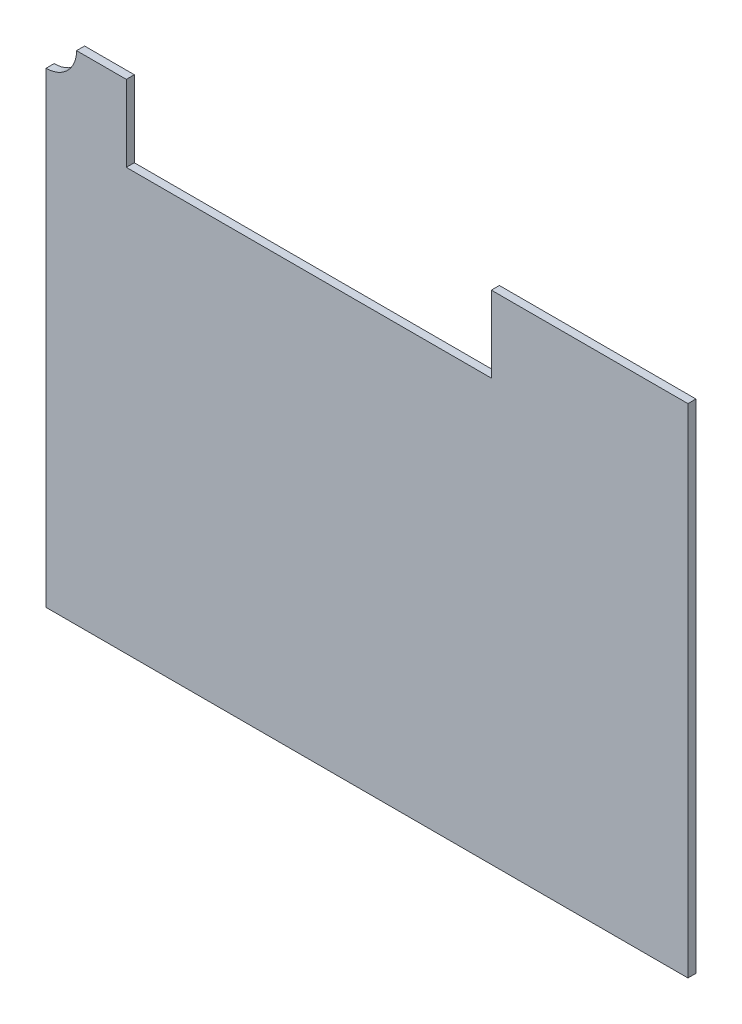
ISO-10303-21;
HEADER;
FILE_DESCRIPTION(('STEP AP214'),'2;1');
FILE_NAME('part.step','',(''),(''),'','','');
FILE_SCHEMA(('AUTOMOTIVE_DESIGN { 1 0 10303 214 1 1 1 1 }'));
ENDSEC;
DATA;
#1=APPLICATION_CONTEXT('core data for automotive mechanical design processes');
#2=APPLICATION_PROTOCOL_DEFINITION('international standard','automotive_design',2000,#1);
#3=PRODUCT_CONTEXT('',#1,'mechanical');
#4=PRODUCT('Part','Part','',(#3));
#5=PRODUCT_RELATED_PRODUCT_CATEGORY('part','',(#4));
#6=PRODUCT_DEFINITION_FORMATION('','',#4);
#7=PRODUCT_DEFINITION_CONTEXT('part definition',#1,'design');
#8=PRODUCT_DEFINITION('design','',#6,#7);
#9=PRODUCT_DEFINITION_SHAPE('','',#8);
#10=(LENGTH_UNIT() NAMED_UNIT(*) SI_UNIT(.MILLI.,.METRE.));
#11=(NAMED_UNIT(*) PLANE_ANGLE_UNIT() SI_UNIT($,.RADIAN.));
#12=(NAMED_UNIT(*) SI_UNIT($,.STERADIAN.) SOLID_ANGLE_UNIT());
#13=UNCERTAINTY_MEASURE_WITH_UNIT(LENGTH_MEASURE(1.E-05),#10,'distance_accuracy_value','');
#14=(GEOMETRIC_REPRESENTATION_CONTEXT(3) GLOBAL_UNCERTAINTY_ASSIGNED_CONTEXT((#13)) GLOBAL_UNIT_ASSIGNED_CONTEXT((#10,
#11,#12)) REPRESENTATION_CONTEXT('',''));
#15=CARTESIAN_POINT('',(0.,0.,0.));
#16=DIRECTION('',(0.,0.,1.));
#17=DIRECTION('',(1.,0.,0.));
#18=AXIS2_PLACEMENT_3D('',#15,#16,#17);
#19=CARTESIAN_POINT('',(-54.2602898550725,44.7444927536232,1.));
#20=DIRECTION('',(1.,0.,0.));
#21=DIRECTION('',(0.,1.,0.));
#22=AXIS2_PLACEMENT_3D('',#19,#20,#21);
#23=PLANE('',#22);
#24=DIRECTION('',(0.,-1.,0.));
#25=VECTOR('',#24,1.);
#26=CARTESIAN_POINT('',(-54.2602898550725,44.7444927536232,1.));
#27=LINE('',#26,#25);
#28=CARTESIAN_POINT('',(-54.2602898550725,40.9418025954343,1.));
#29=VERTEX_POINT('',#28);
#30=CARTESIAN_POINT('',(-54.2602898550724,-17.2555072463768,1.));
#31=VERTEX_POINT('',#30);
#32=EDGE_CURVE('E111',#29,#31,#27,.T.);
#33=ORIENTED_EDGE('',*,*,#32,.F.);
#34=DIRECTION('',(0.,0.,1.));
#35=VECTOR('',#34,1.);
#36=CARTESIAN_POINT('',(-54.2602898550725,40.9418025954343,0.));
#37=LINE('',#36,#35);
#38=CARTESIAN_POINT('',(-54.2602898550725,40.9418025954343,0.));
#39=VERTEX_POINT('',#38);
#40=EDGE_CURVE('E101',#39,#29,#37,.T.);
#41=ORIENTED_EDGE('',*,*,#40,.F.);
#42=DIRECTION('',(0.,-1.,0.));
#43=VECTOR('',#42,1.);
#44=CARTESIAN_POINT('',(-54.2602898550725,44.7444927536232,0.));
#45=LINE('',#44,#43);
#46=CARTESIAN_POINT('',(-54.2602898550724,-17.2555072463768,0.));
#47=VERTEX_POINT('',#46);
#48=EDGE_CURVE('E169',#39,#47,#45,.T.);
#49=ORIENTED_EDGE('',*,*,#48,.T.);
#50=DIRECTION('',(0.,0.,-1.));
#51=VECTOR('',#50,1.);
#52=CARTESIAN_POINT('',(-54.2602898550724,-17.2555072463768,1.));
#53=LINE('',#52,#51);
#54=EDGE_CURVE('E11',#31,#47,#53,.T.);
#55=ORIENTED_EDGE('',*,*,#54,.F.);
#56=EDGE_LOOP('',(#33,#41,#49,#55));
#57=FACE_BOUND('',#56,.T.);
#58=ADVANCED_FACE('F32',(#57),#23,.F.);
#59=CARTESIAN_POINT('',(-54.2602898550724,-17.2555072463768,1.));
#60=DIRECTION('',(0.,1.,0.));
#61=DIRECTION('',(0.,0.,1.));
#62=AXIS2_PLACEMENT_3D('',#59,#60,#61);
#63=PLANE('',#62);
#64=DIRECTION('',(1.,0.,0.));
#65=VECTOR('',#64,1.);
#66=CARTESIAN_POINT('',(-54.2602898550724,-17.2555072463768,0.));
#67=LINE('',#66,#65);
#68=CARTESIAN_POINT('',(25.7397101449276,-17.2555072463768,0.));
#69=VERTEX_POINT('',#68);
#70=EDGE_CURVE('E163',#47,#69,#67,.T.);
#71=ORIENTED_EDGE('',*,*,#70,.T.);
#72=DIRECTION('',(0.,0.,-1.));
#73=VECTOR('',#72,1.);
#74=CARTESIAN_POINT('',(25.7397101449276,-17.2555072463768,1.));
#75=LINE('',#74,#73);
#76=CARTESIAN_POINT('',(25.7397101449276,-17.2555072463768,1.));
#77=VERTEX_POINT('',#76);
#78=EDGE_CURVE('E39',#77,#69,#75,.T.);
#79=ORIENTED_EDGE('',*,*,#78,.F.);
#80=DIRECTION('',(1.,0.,0.));
#81=VECTOR('',#80,1.);
#82=CARTESIAN_POINT('',(-54.2602898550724,-17.2555072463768,1.));
#83=LINE('',#82,#81);
#84=EDGE_CURVE('E117',#31,#77,#83,.T.);
#85=ORIENTED_EDGE('',*,*,#84,.F.);
#86=ORIENTED_EDGE('',*,*,#54,.T.);
#87=EDGE_LOOP('',(#71,#79,#85,#86));
#88=FACE_BOUND('',#87,.T.);
#89=ADVANCED_FACE('F195',(#88),#63,.F.);
#90=CARTESIAN_POINT('',(25.7397101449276,-17.2555072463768,1.));
#91=DIRECTION('',(-1.,0.,0.));
#92=DIRECTION('',(0.,0.,1.));
#93=AXIS2_PLACEMENT_3D('',#90,#91,#92);
#94=PLANE('',#93);
#95=DIRECTION('',(0.,1.,0.));
#96=VECTOR('',#95,1.);
#97=CARTESIAN_POINT('',(25.7397101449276,-17.2555072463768,0.));
#98=LINE('',#97,#96);
#99=CARTESIAN_POINT('',(25.7397101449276,44.7444927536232,0.));
#100=VERTEX_POINT('',#99);
#101=EDGE_CURVE('E157',#69,#100,#98,.T.);
#102=ORIENTED_EDGE('',*,*,#101,.T.);
#103=DIRECTION('',(0.,0.,-1.));
#104=VECTOR('',#103,1.);
#105=CARTESIAN_POINT('',(25.7397101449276,44.7444927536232,1.));
#106=LINE('',#105,#104);
#107=CARTESIAN_POINT('',(25.7397101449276,44.7444927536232,1.));
#108=VERTEX_POINT('',#107);
#109=EDGE_CURVE('E148',#108,#100,#106,.T.);
#110=ORIENTED_EDGE('',*,*,#109,.F.);
#111=DIRECTION('',(0.,1.,0.));
#112=VECTOR('',#111,1.);
#113=CARTESIAN_POINT('',(25.7397101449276,-17.2555072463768,1.));
#114=LINE('',#113,#112);
#115=EDGE_CURVE('E120',#77,#108,#114,.T.);
#116=ORIENTED_EDGE('',*,*,#115,.F.);
#117=ORIENTED_EDGE('',*,*,#78,.T.);
#118=EDGE_LOOP('',(#102,#110,#116,#117));
#119=FACE_BOUND('',#118,.T.);
#120=ADVANCED_FACE('F155',(#119),#94,.F.);
#121=CARTESIAN_POINT('',(25.7397101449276,44.7444927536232,1.));
#122=DIRECTION('',(0.,-1.,0.));
#123=DIRECTION('',(0.,0.,-1.));
#124=AXIS2_PLACEMENT_3D('',#121,#122,#123);
#125=PLANE('',#124);
#126=DIRECTION('',(-1.,0.,0.));
#127=VECTOR('',#126,1.);
#128=CARTESIAN_POINT('',(25.7397101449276,44.7444927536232,0.));
#129=LINE('',#128,#127);
#130=CARTESIAN_POINT('',(1.23971014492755,44.7444927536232,0.));
#131=VERTEX_POINT('',#130);
#132=EDGE_CURVE('E165',#100,#131,#129,.T.);
#133=ORIENTED_EDGE('',*,*,#132,.T.);
#134=DIRECTION('',(0.,0.,-1.));
#135=VECTOR('',#134,1.);
#136=CARTESIAN_POINT('',(1.23971014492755,44.7444927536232,1.));
#137=LINE('',#136,#135);
#138=CARTESIAN_POINT('',(1.23971014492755,44.7444927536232,1.));
#139=VERTEX_POINT('',#138);
#140=EDGE_CURVE('E145',#139,#131,#137,.T.);
#141=ORIENTED_EDGE('',*,*,#140,.F.);
#142=DIRECTION('',(-1.,0.,0.));
#143=VECTOR('',#142,1.);
#144=CARTESIAN_POINT('',(25.7397101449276,44.7444927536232,1.));
#145=LINE('',#144,#143);
#146=EDGE_CURVE('E128',#108,#139,#145,.T.);
#147=ORIENTED_EDGE('',*,*,#146,.F.);
#148=ORIENTED_EDGE('',*,*,#109,.T.);
#149=EDGE_LOOP('',(#133,#141,#147,#148));
#150=FACE_BOUND('',#149,.T.);
#151=ADVANCED_FACE('F202',(#150),#125,.F.);
#152=CARTESIAN_POINT('',(1.23971014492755,44.7444927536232,1.));
#153=DIRECTION('',(1.,0.,0.));
#154=DIRECTION('',(0.,1.,0.));
#155=AXIS2_PLACEMENT_3D('',#152,#153,#154);
#156=PLANE('',#155);
#157=DIRECTION('',(0.,-1.,0.));
#158=VECTOR('',#157,1.);
#159=CARTESIAN_POINT('',(1.23971014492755,44.7444927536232,0.));
#160=LINE('',#159,#158);
#161=CARTESIAN_POINT('',(1.23971014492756,35.2444927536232,0.));
#162=VERTEX_POINT('',#161);
#163=EDGE_CURVE('E167',#131,#162,#160,.T.);
#164=ORIENTED_EDGE('',*,*,#163,.T.);
#165=DIRECTION('',(0.,0.,-1.));
#166=VECTOR('',#165,1.);
#167=CARTESIAN_POINT('',(1.23971014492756,35.2444927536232,1.));
#168=LINE('',#167,#166);
#169=CARTESIAN_POINT('',(1.23971014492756,35.2444927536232,1.));
#170=VERTEX_POINT('',#169);
#171=EDGE_CURVE('E142',#170,#162,#168,.T.);
#172=ORIENTED_EDGE('',*,*,#171,.F.);
#173=DIRECTION('',(0.,-1.,0.));
#174=VECTOR('',#173,1.);
#175=CARTESIAN_POINT('',(1.23971014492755,44.7444927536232,1.));
#176=LINE('',#175,#174);
#177=EDGE_CURVE('E130',#139,#170,#176,.T.);
#178=ORIENTED_EDGE('',*,*,#177,.F.);
#179=ORIENTED_EDGE('',*,*,#140,.T.);
#180=EDGE_LOOP('',(#164,#172,#178,#179));
#181=FACE_BOUND('',#180,.T.);
#182=ADVANCED_FACE('F207',(#181),#156,.F.);
#183=CARTESIAN_POINT('',(1.23971014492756,35.2444927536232,1.));
#184=DIRECTION('',(0.,-1.,0.));
#185=DIRECTION('',(1.,0.,0.));
#186=AXIS2_PLACEMENT_3D('',#183,#184,#185);
#187=PLANE('',#186);
#188=DIRECTION('',(-1.,0.,0.));
#189=VECTOR('',#188,1.);
#190=CARTESIAN_POINT('',(1.23971014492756,35.2444927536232,0.));
#191=LINE('',#190,#189);
#192=CARTESIAN_POINT('',(-44.2602898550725,35.2444927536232,0.));
#193=VERTEX_POINT('',#192);
#194=EDGE_CURVE('E174',#162,#193,#191,.T.);
#195=ORIENTED_EDGE('',*,*,#194,.T.);
#196=DIRECTION('',(0.,0.,-1.));
#197=VECTOR('',#196,1.);
#198=CARTESIAN_POINT('',(-44.2602898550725,35.2444927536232,1.));
#199=LINE('',#198,#197);
#200=CARTESIAN_POINT('',(-44.2602898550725,35.2444927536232,1.));
#201=VERTEX_POINT('',#200);
#202=EDGE_CURVE('E139',#201,#193,#199,.T.);
#203=ORIENTED_EDGE('',*,*,#202,.F.);
#204=DIRECTION('',(-1.,0.,0.));
#205=VECTOR('',#204,1.);
#206=CARTESIAN_POINT('',(1.23971014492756,35.2444927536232,1.));
#207=LINE('',#206,#205);
#208=EDGE_CURVE('E132',#170,#201,#207,.T.);
#209=ORIENTED_EDGE('',*,*,#208,.F.);
#210=ORIENTED_EDGE('',*,*,#171,.T.);
#211=EDGE_LOOP('',(#195,#203,#209,#210));
#212=FACE_BOUND('',#211,.T.);
#213=ADVANCED_FACE('F192',(#212),#187,.F.);
#214=CARTESIAN_POINT('',(-44.2602898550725,35.2444927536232,1.));
#215=DIRECTION('',(-1.,0.,0.));
#216=DIRECTION('',(0.,-1.,0.));
#217=AXIS2_PLACEMENT_3D('',#214,#215,#216);
#218=PLANE('',#217);
#219=DIRECTION('',(0.,1.,0.));
#220=VECTOR('',#219,1.);
#221=CARTESIAN_POINT('',(-44.2602898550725,35.2444927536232,0.));
#222=LINE('',#221,#220);
#223=CARTESIAN_POINT('',(-44.2602898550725,44.7444927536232,0.));
#224=VERTEX_POINT('',#223);
#225=EDGE_CURVE('E123',#193,#224,#222,.T.);
#226=ORIENTED_EDGE('',*,*,#225,.T.);
#227=DIRECTION('',(0.,0.,-1.));
#228=VECTOR('',#227,1.);
#229=CARTESIAN_POINT('',(-44.2602898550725,44.7444927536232,1.));
#230=LINE('',#229,#228);
#231=CARTESIAN_POINT('',(-44.2602898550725,44.7444927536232,1.));
#232=VERTEX_POINT('',#231);
#233=EDGE_CURVE('E136',#232,#224,#230,.T.);
#234=ORIENTED_EDGE('',*,*,#233,.F.);
#235=DIRECTION('',(0.,1.,0.));
#236=VECTOR('',#235,1.);
#237=CARTESIAN_POINT('',(-44.2602898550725,35.2444927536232,1.));
#238=LINE('',#237,#236);
#239=EDGE_CURVE('E54',#201,#232,#238,.T.);
#240=ORIENTED_EDGE('',*,*,#239,.F.);
#241=ORIENTED_EDGE('',*,*,#202,.T.);
#242=EDGE_LOOP('',(#226,#234,#240,#241));
#243=FACE_BOUND('',#242,.T.);
#244=ADVANCED_FACE('F177',(#243),#218,.F.);
#245=CARTESIAN_POINT('',(-44.2602898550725,44.7444927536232,1.));
#246=DIRECTION('',(0.,-1.,0.));
#247=DIRECTION('',(0.,0.,-1.));
#248=AXIS2_PLACEMENT_3D('',#245,#246,#247);
#249=PLANE('',#248);
#250=DIRECTION('',(-1.,0.,0.));
#251=VECTOR('',#250,1.);
#252=CARTESIAN_POINT('',(-44.2602898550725,44.7444927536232,0.));
#253=LINE('',#252,#251);
#254=CARTESIAN_POINT('',(-50.4575996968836,44.7444927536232,0.));
#255=VERTEX_POINT('',#254);
#256=EDGE_CURVE('E118',#224,#255,#253,.T.);
#257=ORIENTED_EDGE('',*,*,#256,.T.);
#258=DIRECTION('',(0.,0.,1.));
#259=VECTOR('',#258,1.);
#260=CARTESIAN_POINT('',(-50.4575996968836,44.7444927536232,0.));
#261=LINE('',#260,#259);
#262=CARTESIAN_POINT('',(-50.4575996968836,44.7444927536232,1.));
#263=VERTEX_POINT('',#262);
#264=EDGE_CURVE('E46',#255,#263,#261,.T.);
#265=ORIENTED_EDGE('',*,*,#264,.T.);
#266=DIRECTION('',(-1.,0.,0.));
#267=VECTOR('',#266,1.);
#268=CARTESIAN_POINT('',(-44.2602898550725,44.7444927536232,1.));
#269=LINE('',#268,#267);
#270=EDGE_CURVE('E114',#232,#263,#269,.T.);
#271=ORIENTED_EDGE('',*,*,#270,.F.);
#272=ORIENTED_EDGE('',*,*,#233,.T.);
#273=EDGE_LOOP('',(#257,#265,#271,#272));
#274=FACE_BOUND('',#273,.T.);
#275=ADVANCED_FACE('F182',(#274),#249,.F.);
#276=CARTESIAN_POINT('',(-54.2602898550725,35.2444927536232,1.));
#277=DIRECTION('',(0.,0.,-1.));
#278=DIRECTION('',(-1.,0.,0.));
#279=AXIS2_PLACEMENT_3D('',#276,#277,#278);
#280=PLANE('',#279);
#281=ORIENTED_EDGE('',*,*,#270,.T.);
#282=CARTESIAN_POINT('',(-54.2602898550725,44.7444927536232,1.));
#283=DIRECTION('',(0.,0.,1.));
#284=DIRECTION('',(1.,0.,0.));
#285=AXIS2_PLACEMENT_3D('',#282,#283,#284);
#286=CIRCLE('',#285,3.80269015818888);
#287=EDGE_CURVE('E104',#29,#263,#286,.T.);
#288=ORIENTED_EDGE('',*,*,#287,.F.);
#289=ORIENTED_EDGE('',*,*,#32,.T.);
#290=ORIENTED_EDGE('',*,*,#84,.T.);
#291=ORIENTED_EDGE('',*,*,#115,.T.);
#292=ORIENTED_EDGE('',*,*,#146,.T.);
#293=ORIENTED_EDGE('',*,*,#177,.T.);
#294=ORIENTED_EDGE('',*,*,#208,.T.);
#295=ORIENTED_EDGE('',*,*,#239,.T.);
#296=EDGE_LOOP('',(#281,#288,#289,#290,#291,#292,#293,#294,#295));
#297=FACE_BOUND('',#296,.T.);
#298=ADVANCED_FACE('F110',(#297),#280,.F.);
#299=CARTESIAN_POINT('',(-54.2602898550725,35.2444927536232,0.));
#300=DIRECTION('',(0.,0.,-1.));
#301=DIRECTION('',(-1.,0.,0.));
#302=AXIS2_PLACEMENT_3D('',#299,#300,#301);
#303=PLANE('',#302);
#304=CARTESIAN_POINT('',(-54.2602898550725,44.7444927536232,0.));
#305=DIRECTION('',(0.,0.,1.));
#306=DIRECTION('',(1.,0.,0.));
#307=AXIS2_PLACEMENT_3D('',#304,#305,#306);
#308=CIRCLE('',#307,3.80269015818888);
#309=EDGE_CURVE('E105',#39,#255,#308,.T.);
#310=ORIENTED_EDGE('',*,*,#309,.T.);
#311=ORIENTED_EDGE('',*,*,#256,.F.);
#312=ORIENTED_EDGE('',*,*,#225,.F.);
#313=ORIENTED_EDGE('',*,*,#194,.F.);
#314=ORIENTED_EDGE('',*,*,#163,.F.);
#315=ORIENTED_EDGE('',*,*,#132,.F.);
#316=ORIENTED_EDGE('',*,*,#101,.F.);
#317=ORIENTED_EDGE('',*,*,#70,.F.);
#318=ORIENTED_EDGE('',*,*,#48,.F.);
#319=EDGE_LOOP('',(#310,#311,#312,#313,#314,#315,#316,#317,#318));
#320=FACE_BOUND('',#319,.T.);
#321=ADVANCED_FACE('F162',(#320),#303,.T.);
#322=CARTESIAN_POINT('',(-54.2602898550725,44.7444927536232,0.));
#323=DIRECTION('',(0.,0.,1.));
#324=DIRECTION('',(1.,0.,0.));
#325=AXIS2_PLACEMENT_3D('',#322,#323,#324);
#326=CYLINDRICAL_SURFACE('',#325,3.80269015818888);
#327=ORIENTED_EDGE('',*,*,#287,.T.);
#328=ORIENTED_EDGE('',*,*,#264,.F.);
#329=ORIENTED_EDGE('',*,*,#309,.F.);
#330=ORIENTED_EDGE('',*,*,#40,.T.);
#331=EDGE_LOOP('',(#327,#328,#329,#330));
#332=FACE_BOUND('',#331,.T.);
#333=ADVANCED_FACE('F103',(#332),#326,.F.);
#334=CLOSED_SHELL('',(#58,#89,#120,#151,#182,#213,#244,#275,#298,#321,#333));
#335=MANIFOLD_SOLID_BREP('B2',#334);
#336=ADVANCED_BREP_SHAPE_REPRESENTATION('',(#18,#335),#14);
#337=SHAPE_DEFINITION_REPRESENTATION(#9,#336);
ENDSEC;
END-ISO-10303-21;
